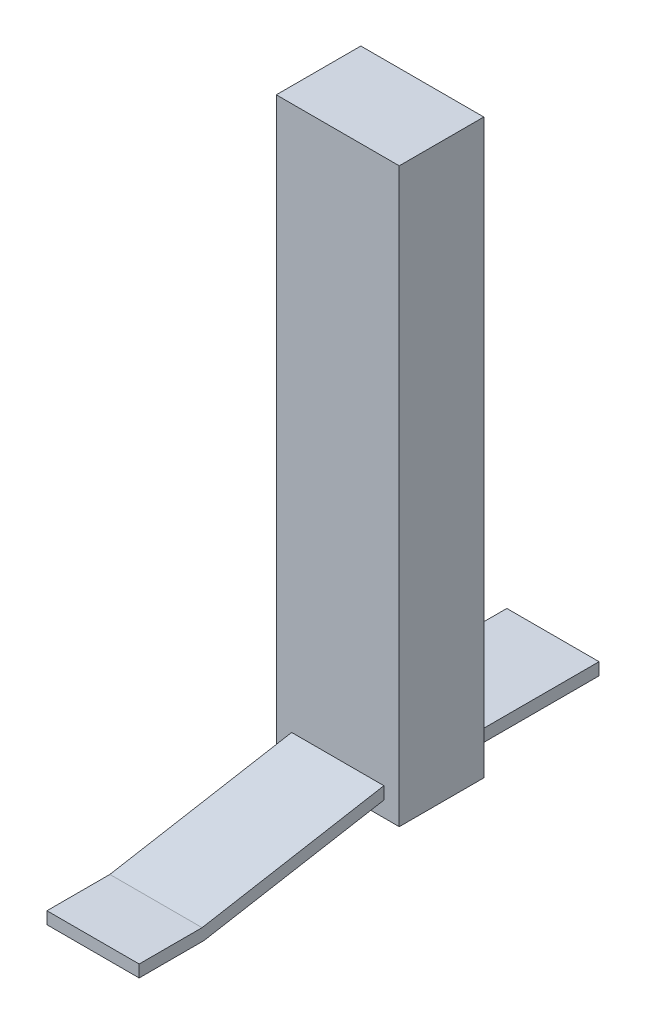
ISO-10303-21;
HEADER;
FILE_DESCRIPTION(('STEP AP214'),'2;1');
FILE_NAME('part.step','',(''),(''),'','','');
FILE_SCHEMA(('AUTOMOTIVE_DESIGN { 1 0 10303 214 1 1 1 1 }'));
ENDSEC;
DATA;
#1=APPLICATION_CONTEXT('core data for automotive mechanical design processes');
#2=APPLICATION_PROTOCOL_DEFINITION('international standard','automotive_design',2000,#1);
#3=PRODUCT_CONTEXT('',#1,'mechanical');
#4=PRODUCT('Part','Part','',(#3));
#5=PRODUCT_RELATED_PRODUCT_CATEGORY('part','',(#4));
#6=PRODUCT_DEFINITION_FORMATION('','',#4);
#7=PRODUCT_DEFINITION_CONTEXT('part definition',#1,'design');
#8=PRODUCT_DEFINITION('design','',#6,#7);
#9=PRODUCT_DEFINITION_SHAPE('','',#8);
#10=(LENGTH_UNIT() NAMED_UNIT(*) SI_UNIT(.MILLI.,.METRE.));
#11=(NAMED_UNIT(*) PLANE_ANGLE_UNIT() SI_UNIT($,.RADIAN.));
#12=(NAMED_UNIT(*) SI_UNIT($,.STERADIAN.) SOLID_ANGLE_UNIT());
#13=UNCERTAINTY_MEASURE_WITH_UNIT(LENGTH_MEASURE(1.E-05),#10,'distance_accuracy_value','');
#14=(GEOMETRIC_REPRESENTATION_CONTEXT(3) GLOBAL_UNCERTAINTY_ASSIGNED_CONTEXT((#13)) GLOBAL_UNIT_ASSIGNED_CONTEXT((#10,
#11,#12)) REPRESENTATION_CONTEXT('',''));
#15=CARTESIAN_POINT('',(0.,0.,0.));
#16=DIRECTION('',(0.,0.,1.));
#17=DIRECTION('',(1.,0.,0.));
#18=AXIS2_PLACEMENT_3D('',#15,#16,#17);
#19=CARTESIAN_POINT('',(29.9999999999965,423.241009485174,-151.69280101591));
#20=DIRECTION('',(1.,0.,0.));
#21=DIRECTION('',(0.,0.,1.));
#22=AXIS2_PLACEMENT_3D('',#19,#20,#21);
#23=PLANE('',#22);
#24=DIRECTION('',(0.,1.,0.));
#25=VECTOR('',#24,1.);
#26=CARTESIAN_POINT('',(29.9999999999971,564.891009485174,-206.692801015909));
#27=LINE('',#26,#25);
#28=CARTESIAN_POINT('',(29.9999999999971,434.141009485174,-206.69280101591));
#29=VERTEX_POINT('',#28);
#30=CARTESIAN_POINT('',(29.9999999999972,442.141009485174,-206.69280101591));
#31=VERTEX_POINT('',#30);
#32=EDGE_CURVE('E34',#29,#31,#27,.T.);
#33=ORIENTED_EDGE('',*,*,#32,.F.);
#34=DIRECTION('',(0.,0.,-1.));
#35=VECTOR('',#34,1.);
#36=CARTESIAN_POINT('',(29.9999999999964,434.141009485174,-141.69280101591));
#37=LINE('',#36,#35);
#38=CARTESIAN_POINT('',(29.999999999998,434.141009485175,-291.69280101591));
#39=VERTEX_POINT('',#38);
#40=EDGE_CURVE('E11',#29,#39,#37,.T.);
#41=ORIENTED_EDGE('',*,*,#40,.T.);
#42=DIRECTION('',(0.,1.,0.));
#43=VECTOR('',#42,1.);
#44=CARTESIAN_POINT('',(29.9999999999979,579.56333362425,-291.692801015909));
#45=LINE('',#44,#43);
#46=CARTESIAN_POINT('',(29.999999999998,442.141009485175,-291.69280101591));
#47=VERTEX_POINT('',#46);
#48=EDGE_CURVE('E21',#39,#47,#45,.T.);
#49=ORIENTED_EDGE('',*,*,#48,.T.);
#50=DIRECTION('',(0.,0.,-1.));
#51=VECTOR('',#50,1.);
#52=CARTESIAN_POINT('',(29.9999999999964,442.141009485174,-146.69280101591));
#53=LINE('',#52,#51);
#54=EDGE_CURVE('E179',#31,#47,#53,.T.);
#55=ORIENTED_EDGE('',*,*,#54,.F.);
#56=EDGE_LOOP('',(#33,#41,#49,#55));
#57=FACE_BOUND('',#56,.T.);
#58=ADVANCED_FACE('F17',(#57),#23,.T.);
#59=CARTESIAN_POINT('',(-30.0000000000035,423.241009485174,-151.69280101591));
#60=DIRECTION('',(-1.,0.,0.));
#61=DIRECTION('',(0.,0.,-1.));
#62=AXIS2_PLACEMENT_3D('',#59,#60,#61);
#63=PLANE('',#62);
#64=DIRECTION('',(0.,-1.,0.));
#65=VECTOR('',#64,1.);
#66=CARTESIAN_POINT('',(-30.0000000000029,564.891009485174,-206.692801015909));
#67=LINE('',#66,#65);
#68=CARTESIAN_POINT('',(-30.0000000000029,442.141009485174,-206.69280101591));
#69=VERTEX_POINT('',#68);
#70=CARTESIAN_POINT('',(-30.000000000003,434.141009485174,-206.69280101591));
#71=VERTEX_POINT('',#70);
#72=EDGE_CURVE('E190',#69,#71,#67,.T.);
#73=ORIENTED_EDGE('',*,*,#72,.F.);
#74=DIRECTION('',(0.,0.,-1.));
#75=VECTOR('',#74,1.);
#76=CARTESIAN_POINT('',(-30.0000000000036,442.141009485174,-141.69280101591));
#77=LINE('',#76,#75);
#78=CARTESIAN_POINT('',(-30.000000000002,442.141009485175,-291.69280101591));
#79=VERTEX_POINT('',#78);
#80=EDGE_CURVE('E161',#69,#79,#77,.T.);
#81=ORIENTED_EDGE('',*,*,#80,.T.);
#82=DIRECTION('',(0.,-1.,0.));
#83=VECTOR('',#82,1.);
#84=CARTESIAN_POINT('',(-30.000000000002,579.56333362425,-291.692801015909));
#85=LINE('',#84,#83);
#86=CARTESIAN_POINT('',(-30.000000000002,434.141009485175,-291.69280101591));
#87=VERTEX_POINT('',#86);
#88=EDGE_CURVE('E157',#79,#87,#85,.T.);
#89=ORIENTED_EDGE('',*,*,#88,.T.);
#90=DIRECTION('',(0.,0.,-1.));
#91=VECTOR('',#90,1.);
#92=CARTESIAN_POINT('',(-30.0000000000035,434.141009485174,-146.69280101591));
#93=LINE('',#92,#91);
#94=EDGE_CURVE('E162',#71,#87,#93,.T.);
#95=ORIENTED_EDGE('',*,*,#94,.F.);
#96=EDGE_LOOP('',(#73,#81,#89,#95));
#97=FACE_BOUND('',#96,.T.);
#98=ADVANCED_FACE('F291',(#97),#63,.T.);
#99=CARTESIAN_POINT('',(-3.58935971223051E-12,434.141009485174,-141.69280101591));
#100=DIRECTION('',(0.,-1.,0.));
#101=DIRECTION('',(-1.,0.,0.));
#102=AXIS2_PLACEMENT_3D('',#99,#100,#101);
#103=PLANE('',#102);
#104=DIRECTION('',(1.,0.,0.));
#105=VECTOR('',#104,1.);
#106=CARTESIAN_POINT('',(-2.87454521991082E-12,434.141009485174,-206.69280101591));
#107=LINE('',#106,#105);
#108=EDGE_CURVE('E194',#71,#29,#107,.T.);
#109=ORIENTED_EDGE('',*,*,#108,.F.);
#110=ORIENTED_EDGE('',*,*,#94,.T.);
#111=DIRECTION('',(1.,0.,0.));
#112=VECTOR('',#111,1.);
#113=CARTESIAN_POINT('',(-0.0038300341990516,434.141009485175,-291.69280101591));
#114=LINE('',#113,#112);
#115=EDGE_CURVE('E175',#87,#39,#114,.T.);
#116=ORIENTED_EDGE('',*,*,#115,.T.);
#117=ORIENTED_EDGE('',*,*,#40,.F.);
#118=EDGE_LOOP('',(#109,#110,#116,#117));
#119=FACE_BOUND('',#118,.T.);
#120=ADVANCED_FACE('F296',(#119),#103,.T.);
#121=CARTESIAN_POINT('',(-0.00766006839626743,706.085657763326,-291.692801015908));
#122=DIRECTION('',(0.,0.,1.));
#123=DIRECTION('',(0.,-1.,0.));
#124=AXIS2_PLACEMENT_3D('',#121,#122,#123);
#125=PLANE('',#124);
#126=ORIENTED_EDGE('',*,*,#48,.F.);
#127=ORIENTED_EDGE('',*,*,#115,.F.);
#128=ORIENTED_EDGE('',*,*,#88,.F.);
#129=DIRECTION('',(-1.,0.,0.));
#130=VECTOR('',#129,1.);
#131=CARTESIAN_POINT('',(-0.00383003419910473,442.141009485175,-291.69280101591));
#132=LINE('',#131,#130);
#133=EDGE_CURVE('E211',#47,#79,#132,.T.);
#134=ORIENTED_EDGE('',*,*,#133,.F.);
#135=EDGE_LOOP('',(#126,#127,#128,#134));
#136=FACE_BOUND('',#135,.T.);
#137=ADVANCED_FACE('F299',(#136),#125,.F.);
#138=CARTESIAN_POINT('',(-3.53146331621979E-12,442.141009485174,-141.69280101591));
#139=DIRECTION('',(0.,1.,0.));
#140=DIRECTION('',(1.,0.,0.));
#141=AXIS2_PLACEMENT_3D('',#138,#139,#140);
#142=PLANE('',#141);
#143=DIRECTION('',(-1.,0.,0.));
#144=VECTOR('',#143,1.);
#145=CARTESIAN_POINT('',(-2.84624754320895E-12,442.141009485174,-206.69280101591));
#146=LINE('',#145,#144);
#147=EDGE_CURVE('E147',#31,#69,#146,.T.);
#148=ORIENTED_EDGE('',*,*,#147,.F.);
#149=ORIENTED_EDGE('',*,*,#54,.T.);
#150=ORIENTED_EDGE('',*,*,#133,.T.);
#151=ORIENTED_EDGE('',*,*,#80,.F.);
#152=EDGE_LOOP('',(#148,#149,#150,#151));
#153=FACE_BOUND('',#152,.T.);
#154=ADVANCED_FACE('F287',(#153),#142,.T.);
#155=CARTESIAN_POINT('',(-40.0000000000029,631.541009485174,-206.692801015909));
#156=DIRECTION('',(-1.,0.,0.));
#157=DIRECTION('',(0.,-1.,0.));
#158=AXIS2_PLACEMENT_3D('',#155,#156,#157);
#159=PLANE('',#158);
#160=DIRECTION('',(0.,1.,0.));
#161=VECTOR('',#160,1.);
#162=CARTESIAN_POINT('',(-40.0000000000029,466.541009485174,-206.69280101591));
#163=LINE('',#162,#161);
#164=CARTESIAN_POINT('',(-40.0000000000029,424.141009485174,-206.692801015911));
#165=VERTEX_POINT('',#164);
#166=CARTESIAN_POINT('',(-40.0000000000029,796.541009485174,-206.692801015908));
#167=VERTEX_POINT('',#166);
#168=EDGE_CURVE('E166',#165,#167,#163,.T.);
#169=ORIENTED_EDGE('',*,*,#168,.F.);
#170=DIRECTION('',(0.,0.,1.));
#171=VECTOR('',#170,1.);
#172=CARTESIAN_POINT('',(-40.0000000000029,424.141009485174,-206.692801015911));
#173=LINE('',#172,#171);
#174=CARTESIAN_POINT('',(-40.0000000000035,424.141009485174,-151.692801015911));
#175=VERTEX_POINT('',#174);
#176=EDGE_CURVE('E152',#165,#175,#173,.T.);
#177=ORIENTED_EDGE('',*,*,#176,.T.);
#178=DIRECTION('',(0.,1.,0.));
#179=VECTOR('',#178,1.);
#180=CARTESIAN_POINT('',(-40.0000000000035,466.541009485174,-151.69280101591));
#181=LINE('',#180,#179);
#182=CARTESIAN_POINT('',(-40.0000000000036,796.541009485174,-151.692801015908));
#183=VERTEX_POINT('',#182);
#184=EDGE_CURVE('E149',#175,#183,#181,.T.);
#185=ORIENTED_EDGE('',*,*,#184,.T.);
#186=DIRECTION('',(0.,0.,1.));
#187=VECTOR('',#186,1.);
#188=CARTESIAN_POINT('',(-40.0000000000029,796.541009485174,-206.692801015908));
#189=LINE('',#188,#187);
#190=EDGE_CURVE('E128',#167,#183,#189,.T.);
#191=ORIENTED_EDGE('',*,*,#190,.F.);
#192=EDGE_LOOP('',(#169,#177,#185,#191));
#193=FACE_BOUND('',#192,.T.);
#194=ADVANCED_FACE('F307',(#193),#159,.T.);
#195=CARTESIAN_POINT('',(-2.93992261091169E-12,424.141009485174,-206.69280101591));
#196=DIRECTION('',(0.,-1.,0.));
#197=DIRECTION('',(1.,0.,0.));
#198=AXIS2_PLACEMENT_3D('',#195,#196,#197);
#199=PLANE('',#198);
#200=DIRECTION('',(-1.,0.,0.));
#201=VECTOR('',#200,1.);
#202=CARTESIAN_POINT('',(-2.93992261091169E-12,424.141009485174,-206.69280101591));
#203=LINE('',#202,#201);
#204=CARTESIAN_POINT('',(39.999999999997,424.141009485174,-206.69280101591));
#205=VERTEX_POINT('',#204);
#206=EDGE_CURVE('E170',#205,#165,#203,.T.);
#207=ORIENTED_EDGE('',*,*,#206,.F.);
#208=DIRECTION('',(0.,0.,1.));
#209=VECTOR('',#208,1.);
#210=CARTESIAN_POINT('',(39.999999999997,424.141009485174,-206.69280101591));
#211=LINE('',#210,#209);
#212=CARTESIAN_POINT('',(39.9999999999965,424.141009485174,-151.69280101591));
#213=VERTEX_POINT('',#212);
#214=EDGE_CURVE('E153',#205,#213,#211,.T.);
#215=ORIENTED_EDGE('',*,*,#214,.T.);
#216=DIRECTION('',(-1.,0.,0.));
#217=VECTOR('',#216,1.);
#218=CARTESIAN_POINT('',(-0.00383003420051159,424.141009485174,-151.69280101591));
#219=LINE('',#218,#217);
#220=EDGE_CURVE('E186',#213,#175,#219,.T.);
#221=ORIENTED_EDGE('',*,*,#220,.T.);
#222=ORIENTED_EDGE('',*,*,#176,.F.);
#223=EDGE_LOOP('',(#207,#215,#221,#222));
#224=FACE_BOUND('',#223,.T.);
#225=ADVANCED_FACE('F326',(#224),#199,.T.);
#226=CARTESIAN_POINT('',(-2.89720504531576E-12,706.541009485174,-206.692801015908));
#227=DIRECTION('',(0.,0.,1.));
#228=DIRECTION('',(0.,-1.,0.));
#229=AXIS2_PLACEMENT_3D('',#226,#227,#228);
#230=PLANE('',#229);
#231=ORIENTED_EDGE('',*,*,#72,.T.);
#232=ORIENTED_EDGE('',*,*,#108,.T.);
#233=ORIENTED_EDGE('',*,*,#32,.T.);
#234=ORIENTED_EDGE('',*,*,#147,.T.);
#235=EDGE_LOOP('',(#231,#232,#233,#234));
#236=FACE_BOUND('',#235,.T.);
#237=DIRECTION('',(1.,0.,0.));
#238=VECTOR('',#237,1.);
#239=CARTESIAN_POINT('',(-40.0000000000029,796.541009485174,-206.692801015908));
#240=LINE('',#239,#238);
#241=CARTESIAN_POINT('',(39.9999999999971,796.541009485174,-206.692801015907));
#242=VERTEX_POINT('',#241);
#243=EDGE_CURVE('E204',#167,#242,#240,.T.);
#244=ORIENTED_EDGE('',*,*,#243,.T.);
#245=DIRECTION('',(0.,-1.,0.));
#246=VECTOR('',#245,1.);
#247=CARTESIAN_POINT('',(39.9999999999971,796.541009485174,-206.692801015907));
#248=LINE('',#247,#246);
#249=EDGE_CURVE('E200',#242,#205,#248,.T.);
#250=ORIENTED_EDGE('',*,*,#249,.T.);
#251=ORIENTED_EDGE('',*,*,#206,.T.);
#252=ORIENTED_EDGE('',*,*,#168,.T.);
#253=EDGE_LOOP('',(#244,#250,#251,#252));
#254=FACE_BOUND('',#253,.T.);
#255=ADVANCED_FACE('F281',(#236,#254),#230,.F.);
#256=CARTESIAN_POINT('',(39.9999999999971,631.541009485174,-206.692801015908));
#257=DIRECTION('',(1.,0.,0.));
#258=DIRECTION('',(0.,1.,0.));
#259=AXIS2_PLACEMENT_3D('',#256,#257,#258);
#260=PLANE('',#259);
#261=ORIENTED_EDGE('',*,*,#249,.F.);
#262=DIRECTION('',(0.,0.,1.));
#263=VECTOR('',#262,1.);
#264=CARTESIAN_POINT('',(39.9999999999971,796.541009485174,-206.692801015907));
#265=LINE('',#264,#263);
#266=CARTESIAN_POINT('',(39.9999999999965,796.541009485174,-151.692801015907));
#267=VERTEX_POINT('',#266);
#268=EDGE_CURVE('E171',#242,#267,#265,.T.);
#269=ORIENTED_EDGE('',*,*,#268,.T.);
#270=DIRECTION('',(0.,1.,0.));
#271=VECTOR('',#270,1.);
#272=CARTESIAN_POINT('',(39.9999999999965,635.666009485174,-151.692801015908));
#273=LINE('',#272,#271);
#274=EDGE_CURVE('E165',#213,#267,#273,.T.);
#275=ORIENTED_EDGE('',*,*,#274,.F.);
#276=ORIENTED_EDGE('',*,*,#214,.F.);
#277=EDGE_LOOP('',(#261,#269,#275,#276));
#278=FACE_BOUND('',#277,.T.);
#279=ADVANCED_FACE('F330',(#278),#260,.T.);
#280=CARTESIAN_POINT('',(-0.00766006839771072,706.085657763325,-151.692801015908));
#281=DIRECTION('',(0.,0.,1.));
#282=DIRECTION('',(0.,-1.,0.));
#283=AXIS2_PLACEMENT_3D('',#280,#281,#282);
#284=PLANE('',#283);
#285=DIRECTION('',(0.,1.,0.));
#286=VECTOR('',#285,1.);
#287=CARTESIAN_POINT('',(29.9999999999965,579.532949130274,-151.692801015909));
#288=LINE('',#287,#286);
#289=CARTESIAN_POINT('',(29.9999999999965,434.141009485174,-151.69280101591));
#290=VERTEX_POINT('',#289);
#291=CARTESIAN_POINT('',(29.9999999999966,442.26442238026,-151.69280101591));
#292=VERTEX_POINT('',#291);
#293=EDGE_CURVE('E118',#290,#292,#288,.T.);
#294=ORIENTED_EDGE('',*,*,#293,.F.);
#295=DIRECTION('',(1.,0.,0.));
#296=VECTOR('',#295,1.);
#297=CARTESIAN_POINT('',(14.9961699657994,434.141009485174,-151.69280101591));
#298=LINE('',#297,#296);
#299=CARTESIAN_POINT('',(-30.0000000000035,434.141009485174,-151.69280101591));
#300=VERTEX_POINT('',#299);
#301=EDGE_CURVE('E103',#300,#290,#298,.T.);
#302=ORIENTED_EDGE('',*,*,#301,.F.);
#303=DIRECTION('',(0.,-1.,0.));
#304=VECTOR('',#303,1.);
#305=CARTESIAN_POINT('',(-30.0000000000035,564.663333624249,-151.692801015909));
#306=LINE('',#305,#304);
#307=CARTESIAN_POINT('',(-30.0000000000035,442.26442238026,-151.69280101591));
#308=VERTEX_POINT('',#307);
#309=EDGE_CURVE('E134',#308,#300,#306,.T.);
#310=ORIENTED_EDGE('',*,*,#309,.F.);
#311=DIRECTION('',(-1.,0.,0.));
#312=VECTOR('',#311,1.);
#313=CARTESIAN_POINT('',(14.9961699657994,442.26442238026,-151.69280101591));
#314=LINE('',#313,#312);
#315=EDGE_CURVE('E123',#292,#308,#314,.T.);
#316=ORIENTED_EDGE('',*,*,#315,.F.);
#317=EDGE_LOOP('',(#294,#302,#310,#316));
#318=FACE_BOUND('',#317,.T.);
#319=DIRECTION('',(-1.,0.,0.));
#320=VECTOR('',#319,1.);
#321=CARTESIAN_POINT('',(-1.00000000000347,796.541009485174,-151.692801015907));
#322=LINE('',#321,#320);
#323=EDGE_CURVE('E254',#267,#183,#322,.T.);
#324=ORIENTED_EDGE('',*,*,#323,.T.);
#325=ORIENTED_EDGE('',*,*,#184,.F.);
#326=ORIENTED_EDGE('',*,*,#220,.F.);
#327=ORIENTED_EDGE('',*,*,#274,.T.);
#328=EDGE_LOOP('',(#324,#325,#326,#327));
#329=FACE_BOUND('',#328,.T.);
#330=ADVANCED_FACE('F119',(#318,#329),#284,.T.);
#331=CARTESIAN_POINT('',(-2.91281755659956E-12,796.541009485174,-206.692801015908));
#332=DIRECTION('',(0.,1.,0.));
#333=DIRECTION('',(-1.,0.,0.));
#334=AXIS2_PLACEMENT_3D('',#331,#332,#333);
#335=PLANE('',#334);
#336=ORIENTED_EDGE('',*,*,#323,.F.);
#337=ORIENTED_EDGE('',*,*,#268,.F.);
#338=ORIENTED_EDGE('',*,*,#243,.F.);
#339=ORIENTED_EDGE('',*,*,#190,.T.);
#340=EDGE_LOOP('',(#336,#337,#338,#339));
#341=FACE_BOUND('',#340,.T.);
#342=ADVANCED_FACE('F325',(#341),#335,.T.);
#343=CARTESIAN_POINT('',(29.9999999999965,423.241009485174,-151.69280101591));
#344=DIRECTION('',(1.,0.,0.));
#345=DIRECTION('',(0.,0.,1.));
#346=AXIS2_PLACEMENT_3D('',#343,#344,#345);
#347=PLANE('',#346);
#348=ORIENTED_EDGE('',*,*,#293,.T.);
#349=DIRECTION('',(0.,0.173648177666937,-0.984807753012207));
#350=VECTOR('',#349,1.);
#351=CARTESIAN_POINT('',(29.9999999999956,427.319683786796,-66.9369767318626));
#352=LINE('',#351,#350);
#353=CARTESIAN_POINT('',(29.9999999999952,421.411207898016,-33.4283448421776));
#354=VERTEX_POINT('',#353);
#355=EDGE_CURVE('E156',#354,#292,#352,.T.);
#356=ORIENTED_EDGE('',*,*,#355,.F.);
#357=DIRECTION('',(0.,0.,-1.));
#358=VECTOR('',#357,1.);
#359=CARTESIAN_POINT('',(29.9999999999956,421.411207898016,-64.0594828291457));
#360=LINE('',#359,#358);
#361=CARTESIAN_POINT('',(29.9999999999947,421.411207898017,7.52152697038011));
#362=VERTEX_POINT('',#361);
#363=EDGE_CURVE('E114',#362,#354,#360,.T.);
#364=ORIENTED_EDGE('',*,*,#363,.F.);
#365=DIRECTION('',(0.,1.,0.));
#366=VECTOR('',#365,1.);
#367=CARTESIAN_POINT('',(29.9999999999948,532.181956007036,7.52152697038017));
#368=LINE('',#367,#366);
#369=CARTESIAN_POINT('',(29.9999999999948,413.513950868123,7.52152697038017));
#370=VERTEX_POINT('',#369);
#371=EDGE_CURVE('E222',#370,#362,#368,.T.);
#372=ORIENTED_EDGE('',*,*,#371,.F.);
#373=DIRECTION('',(0.,0.,-1.));
#374=VECTOR('',#373,1.);
#375=CARTESIAN_POINT('',(29.9999999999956,413.513950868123,-64.6647493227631));
#376=LINE('',#375,#374);
#377=CARTESIAN_POINT('',(29.9999999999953,413.513950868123,-34.7109384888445));
#378=VERTEX_POINT('',#377);
#379=EDGE_CURVE('E129',#370,#378,#376,.T.);
#380=ORIENTED_EDGE('',*,*,#379,.T.);
#381=DIRECTION('',(0.,0.173648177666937,-0.984807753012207));
#382=VECTOR('',#381,1.);
#383=CARTESIAN_POINT('',(29.9999999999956,419.318746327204,-67.6315694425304));
#384=LINE('',#383,#382);
#385=EDGE_CURVE('E107',#378,#290,#384,.T.);
#386=ORIENTED_EDGE('',*,*,#385,.T.);
#387=EDGE_LOOP('',(#348,#356,#364,#372,#380,#386));
#388=FACE_BOUND('',#387,.T.);
#389=ADVANCED_FACE('F131',(#388),#347,.T.);
#390=CARTESIAN_POINT('',(-30.0000000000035,423.241009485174,-151.69280101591));
#391=DIRECTION('',(-1.,0.,0.));
#392=DIRECTION('',(0.,0.,-1.));
#393=AXIS2_PLACEMENT_3D('',#390,#391,#392);
#394=PLANE('',#393);
#395=ORIENTED_EDGE('',*,*,#309,.T.);
#396=DIRECTION('',(0.,0.173648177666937,-0.984807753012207));
#397=VECTOR('',#396,1.);
#398=CARTESIAN_POINT('',(-30.0000000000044,419.318746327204,-67.631569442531));
#399=LINE('',#398,#397);
#400=CARTESIAN_POINT('',(-30.0000000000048,413.513950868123,-34.7109384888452));
#401=VERTEX_POINT('',#400);
#402=EDGE_CURVE('E109',#401,#300,#399,.T.);
#403=ORIENTED_EDGE('',*,*,#402,.F.);
#404=DIRECTION('',(0.,0.,-1.));
#405=VECTOR('',#404,1.);
#406=CARTESIAN_POINT('',(-30.0000000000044,413.513950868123,-64.6647493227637));
#407=LINE('',#406,#405);
#408=CARTESIAN_POINT('',(-30.0000000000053,413.513950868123,7.52152697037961));
#409=VERTEX_POINT('',#408);
#410=EDGE_CURVE('E85',#409,#401,#407,.T.);
#411=ORIENTED_EDGE('',*,*,#410,.F.);
#412=DIRECTION('',(0.,-1.,0.));
#413=VECTOR('',#412,1.);
#414=CARTESIAN_POINT('',(-30.0000000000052,532.181956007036,7.5215269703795));
#415=LINE('',#414,#413);
#416=CARTESIAN_POINT('',(-30.0000000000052,421.411207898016,7.5215269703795));
#417=VERTEX_POINT('',#416);
#418=EDGE_CURVE('E195',#417,#409,#415,.T.);
#419=ORIENTED_EDGE('',*,*,#418,.F.);
#420=DIRECTION('',(0.,0.,-1.));
#421=VECTOR('',#420,1.);
#422=CARTESIAN_POINT('',(-30.0000000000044,421.411207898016,-64.0594828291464));
#423=LINE('',#422,#421);
#424=CARTESIAN_POINT('',(-30.0000000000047,421.411207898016,-33.4283448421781));
#425=VERTEX_POINT('',#424);
#426=EDGE_CURVE('E143',#417,#425,#423,.T.);
#427=ORIENTED_EDGE('',*,*,#426,.T.);
#428=DIRECTION('',(0.,0.173648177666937,-0.984807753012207));
#429=VECTOR('',#428,1.);
#430=CARTESIAN_POINT('',(-30.0000000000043,427.319683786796,-66.9369767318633));
#431=LINE('',#430,#429);
#432=EDGE_CURVE('E198',#425,#308,#431,.T.);
#433=ORIENTED_EDGE('',*,*,#432,.T.);
#434=EDGE_LOOP('',(#395,#403,#411,#419,#427,#433));
#435=FACE_BOUND('',#434,.T.);
#436=ADVANCED_FACE('F324',(#435),#394,.T.);
#437=CARTESIAN_POINT('',(-0.00766006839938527,658.734664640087,7.52152697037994));
#438=DIRECTION('',(0.,0.,1.));
#439=DIRECTION('',(0.,-1.,0.));
#440=AXIS2_PLACEMENT_3D('',#437,#438,#439);
#441=PLANE('',#440);
#442=ORIENTED_EDGE('',*,*,#418,.T.);
#443=DIRECTION('',(1.,0.,0.));
#444=VECTOR('',#443,1.);
#445=CARTESIAN_POINT('',(14.9961699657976,413.513950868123,7.52152697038));
#446=LINE('',#445,#444);
#447=EDGE_CURVE('E199',#409,#370,#446,.T.);
#448=ORIENTED_EDGE('',*,*,#447,.T.);
#449=ORIENTED_EDGE('',*,*,#371,.T.);
#450=DIRECTION('',(-1.,0.,0.));
#451=VECTOR('',#450,1.);
#452=CARTESIAN_POINT('',(14.9961699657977,421.411207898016,7.52152697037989));
#453=LINE('',#452,#451);
#454=EDGE_CURVE('E218',#362,#417,#453,.T.);
#455=ORIENTED_EDGE('',*,*,#454,.T.);
#456=EDGE_LOOP('',(#442,#448,#449,#455));
#457=FACE_BOUND('',#456,.T.);
#458=ADVANCED_FACE('F319',(#457),#441,.T.);
#459=CARTESIAN_POINT('',(-3.53384856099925E-12,434.141009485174,-151.69280101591));
#460=DIRECTION('',(0.,-0.984807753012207,-0.173648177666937));
#461=DIRECTION('',(0.,0.173648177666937,-0.984807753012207));
#462=AXIS2_PLACEMENT_3D('',#459,#460,#461);
#463=PLANE('',#462);
#464=ORIENTED_EDGE('',*,*,#385,.F.);
#465=DIRECTION('',(-1.,0.,0.));
#466=VECTOR('',#465,1.);
#467=CARTESIAN_POINT('',(14.9999999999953,413.513950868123,-34.7109384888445));
#468=LINE('',#467,#466);
#469=EDGE_CURVE('E207',#378,#401,#468,.T.);
#470=ORIENTED_EDGE('',*,*,#469,.T.);
#471=ORIENTED_EDGE('',*,*,#402,.T.);
#472=ORIENTED_EDGE('',*,*,#301,.T.);
#473=EDGE_LOOP('',(#464,#470,#471,#472));
#474=FACE_BOUND('',#473,.T.);
#475=ADVANCED_FACE('F19',(#474),#463,.T.);
#476=CARTESIAN_POINT('',(29.9999999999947,421.411207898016,17.1047091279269));
#477=DIRECTION('',(0.,1.,0.));
#478=DIRECTION('',(-1.,0.,0.));
#479=AXIS2_PLACEMENT_3D('',#476,#477,#478);
#480=PLANE('',#479);
#481=ORIENTED_EDGE('',*,*,#426,.F.);
#482=ORIENTED_EDGE('',*,*,#454,.F.);
#483=ORIENTED_EDGE('',*,*,#363,.T.);
#484=DIRECTION('',(1.,0.,0.));
#485=VECTOR('',#484,1.);
#486=CARTESIAN_POINT('',(14.9999999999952,421.411207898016,-33.4283448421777));
#487=LINE('',#486,#485);
#488=EDGE_CURVE('E182',#425,#354,#487,.T.);
#489=ORIENTED_EDGE('',*,*,#488,.F.);
#490=EDGE_LOOP('',(#481,#482,#483,#489));
#491=FACE_BOUND('',#490,.T.);
#492=ADVANCED_FACE('F336',(#491),#480,.T.);
#493=CARTESIAN_POINT('',(29.9999999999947,413.513950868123,15.694921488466));
#494=DIRECTION('',(0.,1.,0.));
#495=DIRECTION('',(-1.,0.,0.));
#496=AXIS2_PLACEMENT_3D('',#493,#494,#495);
#497=PLANE('',#496);
#498=ORIENTED_EDGE('',*,*,#469,.F.);
#499=ORIENTED_EDGE('',*,*,#379,.F.);
#500=ORIENTED_EDGE('',*,*,#447,.F.);
#501=ORIENTED_EDGE('',*,*,#410,.T.);
#502=EDGE_LOOP('',(#498,#499,#500,#501));
#503=FACE_BOUND('',#502,.T.);
#504=ADVANCED_FACE('F333',(#503),#497,.F.);
#505=CARTESIAN_POINT('',(-3.58784182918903E-12,442.019471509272,-150.303615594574));
#506=DIRECTION('',(0.,0.984807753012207,0.173648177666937));
#507=DIRECTION('',(0.,-0.173648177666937,0.984807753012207));
#508=AXIS2_PLACEMENT_3D('',#505,#506,#507);
#509=PLANE('',#508);
#510=ORIENTED_EDGE('',*,*,#432,.F.);
#511=ORIENTED_EDGE('',*,*,#488,.T.);
#512=ORIENTED_EDGE('',*,*,#355,.T.);
#513=ORIENTED_EDGE('',*,*,#315,.T.);
#514=EDGE_LOOP('',(#510,#511,#512,#513));
#515=FACE_BOUND('',#514,.T.);
#516=ADVANCED_FACE('F335',(#515),#509,.T.);
#517=CLOSED_SHELL('',(#58,#98,#120,#137,#154,#194,#225,#255,#279,#330,#342,#389,#436,#458,#475,
#492,#504,#516));
#518=MANIFOLD_SOLID_BREP('B1',#517);
#519=ADVANCED_BREP_SHAPE_REPRESENTATION('',(#18,#518),#14);
#520=SHAPE_DEFINITION_REPRESENTATION(#9,#519);
ENDSEC;
END-ISO-10303-21;
